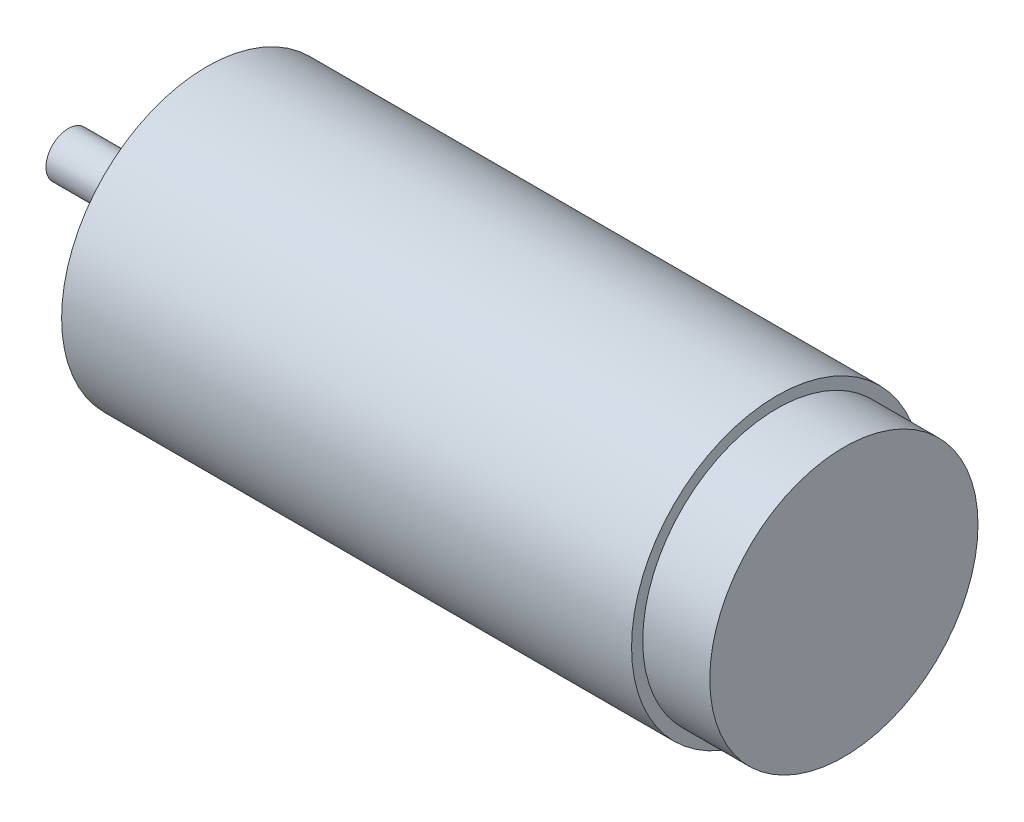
ISO-10303-21;
HEADER;
FILE_DESCRIPTION(('STEP AP214'),'2;1');
FILE_NAME('part.step','',(''),(''),'','','');
FILE_SCHEMA(('AUTOMOTIVE_DESIGN { 1 0 10303 214 1 1 1 1 }'));
ENDSEC;
DATA;
#1=APPLICATION_CONTEXT('core data for automotive mechanical design processes');
#2=APPLICATION_PROTOCOL_DEFINITION('international standard','automotive_design',2000,#1);
#3=PRODUCT_CONTEXT('',#1,'mechanical');
#4=PRODUCT('Part','Part','',(#3));
#5=PRODUCT_RELATED_PRODUCT_CATEGORY('part','',(#4));
#6=PRODUCT_DEFINITION_FORMATION('','',#4);
#7=PRODUCT_DEFINITION_CONTEXT('part definition',#1,'design');
#8=PRODUCT_DEFINITION('design','',#6,#7);
#9=PRODUCT_DEFINITION_SHAPE('','',#8);
#10=(LENGTH_UNIT() NAMED_UNIT(*) SI_UNIT(.MILLI.,.METRE.));
#11=(NAMED_UNIT(*) PLANE_ANGLE_UNIT() SI_UNIT($,.RADIAN.));
#12=(NAMED_UNIT(*) SI_UNIT($,.STERADIAN.) SOLID_ANGLE_UNIT());
#13=UNCERTAINTY_MEASURE_WITH_UNIT(LENGTH_MEASURE(1.E-05),#10,'distance_accuracy_value','');
#14=(GEOMETRIC_REPRESENTATION_CONTEXT(3) GLOBAL_UNCERTAINTY_ASSIGNED_CONTEXT((#13)) GLOBAL_UNIT_ASSIGNED_CONTEXT((#10,
#11,#12)) REPRESENTATION_CONTEXT('',''));
#15=CARTESIAN_POINT('',(0.,0.,0.));
#16=DIRECTION('',(0.,0.,1.));
#17=DIRECTION('',(1.,0.,0.));
#18=AXIS2_PLACEMENT_3D('',#15,#16,#17);
#19=CARTESIAN_POINT('',(0.,0.,0.));
#20=DIRECTION('',(1.,0.,0.));
#21=DIRECTION('',(0.,0.,-1.));
#22=AXIS2_PLACEMENT_3D('',#19,#20,#21);
#23=PLANE('',#22);
#24=CARTESIAN_POINT('',(0.,0.,0.));
#25=DIRECTION('',(1.,0.,0.));
#26=DIRECTION('',(0.,0.,-1.));
#27=AXIS2_PLACEMENT_3D('',#24,#25,#26);
#28=CIRCLE('',#27,12.);
#29=CARTESIAN_POINT('',(0.,0.,-12.));
#30=VERTEX_POINT('',#29);
#31=EDGE_CURVE('E11',#30,#30,#28,.T.);
#32=ORIENTED_EDGE('',*,*,#31,.T.);
#33=EDGE_LOOP('',(#32));
#34=FACE_BOUND('',#33,.T.);
#35=ADVANCED_FACE('F42',(#34),#23,.T.);
#36=CARTESIAN_POINT('',(0.,0.,0.));
#37=DIRECTION('',(1.,0.,0.));
#38=DIRECTION('',(0.,0.,-1.));
#39=AXIS2_PLACEMENT_3D('',#36,#37,#38);
#40=CYLINDRICAL_SURFACE('',#39,12.);
#41=CARTESIAN_POINT('',(-6.,0.,0.));
#42=DIRECTION('',(1.,0.,0.));
#43=DIRECTION('',(0.,0.,-1.));
#44=AXIS2_PLACEMENT_3D('',#41,#42,#43);
#45=CIRCLE('',#44,12.);
#46=CARTESIAN_POINT('',(-6.,0.,-12.));
#47=VERTEX_POINT('',#46);
#48=EDGE_CURVE('E49',#47,#47,#45,.T.);
#49=ORIENTED_EDGE('',*,*,#48,.T.);
#50=EDGE_LOOP('',(#49));
#51=FACE_BOUND('',#50,.T.);
#52=ORIENTED_EDGE('',*,*,#31,.F.);
#53=EDGE_LOOP('',(#52));
#54=FACE_BOUND('',#53,.T.);
#55=ADVANCED_FACE('F120',(#51,#54),#40,.T.);
#56=CARTESIAN_POINT('',(-6.,12.,0.));
#57=DIRECTION('',(1.,0.,0.));
#58=DIRECTION('',(0.,0.,-1.));
#59=AXIS2_PLACEMENT_3D('',#56,#57,#58);
#60=PLANE('',#59);
#61=CARTESIAN_POINT('',(-6.,0.,0.));
#62=DIRECTION('',(1.,0.,0.));
#63=DIRECTION('',(0.,0.,-1.));
#64=AXIS2_PLACEMENT_3D('',#61,#62,#63);
#65=CIRCLE('',#64,13.);
#66=CARTESIAN_POINT('',(-6.,0.,-13.));
#67=VERTEX_POINT('',#66);
#68=EDGE_CURVE('E115',#67,#67,#65,.T.);
#69=ORIENTED_EDGE('',*,*,#68,.T.);
#70=EDGE_LOOP('',(#69));
#71=FACE_BOUND('',#70,.T.);
#72=ORIENTED_EDGE('',*,*,#48,.F.);
#73=EDGE_LOOP('',(#72));
#74=FACE_BOUND('',#73,.T.);
#75=ADVANCED_FACE('F123',(#71,#74),#60,.T.);
#76=CARTESIAN_POINT('',(0.,0.,0.));
#77=DIRECTION('',(1.,0.,0.));
#78=DIRECTION('',(0.,0.,-1.));
#79=AXIS2_PLACEMENT_3D('',#76,#77,#78);
#80=CYLINDRICAL_SURFACE('',#79,13.);
#81=CARTESIAN_POINT('',(-57.,0.,0.));
#82=DIRECTION('',(1.,0.,0.));
#83=DIRECTION('',(0.,0.,-1.));
#84=AXIS2_PLACEMENT_3D('',#81,#82,#83);
#85=CIRCLE('',#84,13.);
#86=CARTESIAN_POINT('',(-57.,0.,-13.));
#87=VERTEX_POINT('',#86);
#88=EDGE_CURVE('E112',#87,#87,#85,.T.);
#89=ORIENTED_EDGE('',*,*,#88,.T.);
#90=EDGE_LOOP('',(#89));
#91=FACE_BOUND('',#90,.T.);
#92=ORIENTED_EDGE('',*,*,#68,.F.);
#93=EDGE_LOOP('',(#92));
#94=FACE_BOUND('',#93,.T.);
#95=ADVANCED_FACE('F125',(#91,#94),#80,.T.);
#96=CARTESIAN_POINT('',(-57.,13.,0.));
#97=DIRECTION('',(-1.,0.,0.));
#98=DIRECTION('',(0.,0.,1.));
#99=AXIS2_PLACEMENT_3D('',#96,#97,#98);
#100=PLANE('',#99);
#101=CARTESIAN_POINT('',(-57.,8.5,0.));
#102=DIRECTION('',(-1.,0.,0.));
#103=DIRECTION('',(0.,0.,1.));
#104=AXIS2_PLACEMENT_3D('',#101,#102,#103);
#105=CIRCLE('',#104,1.5);
#106=CARTESIAN_POINT('',(-57.,8.5,1.5));
#107=VERTEX_POINT('',#106);
#108=EDGE_CURVE('E71',#107,#107,#105,.T.);
#109=ORIENTED_EDGE('',*,*,#108,.F.);
#110=EDGE_LOOP('',(#109));
#111=FACE_BOUND('',#110,.T.);
#112=CARTESIAN_POINT('',(-57.,-4.24999999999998,7.36121593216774));
#113=DIRECTION('',(-1.,0.,0.));
#114=DIRECTION('',(0.,0.,1.));
#115=AXIS2_PLACEMENT_3D('',#112,#113,#114);
#116=CIRCLE('',#115,1.5);
#117=CARTESIAN_POINT('',(-57.,-4.24999999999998,8.86121593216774));
#118=VERTEX_POINT('',#117);
#119=EDGE_CURVE('E82',#118,#118,#116,.T.);
#120=ORIENTED_EDGE('',*,*,#119,.F.);
#121=EDGE_LOOP('',(#120));
#122=FACE_BOUND('',#121,.T.);
#123=CARTESIAN_POINT('',(-57.,-4.25000000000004,-7.36121593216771));
#124=DIRECTION('',(-1.,0.,0.));
#125=DIRECTION('',(0.,0.,1.));
#126=AXIS2_PLACEMENT_3D('',#123,#124,#125);
#127=CIRCLE('',#126,1.5);
#128=CARTESIAN_POINT('',(-57.,-4.25000000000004,-5.86121593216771));
#129=VERTEX_POINT('',#128);
#130=EDGE_CURVE('E91',#129,#129,#127,.T.);
#131=ORIENTED_EDGE('',*,*,#130,.F.);
#132=EDGE_LOOP('',(#131));
#133=FACE_BOUND('',#132,.T.);
#134=CARTESIAN_POINT('',(-57.,0.,0.));
#135=DIRECTION('',(1.,0.,0.));
#136=DIRECTION('',(0.,0.,-1.));
#137=AXIS2_PLACEMENT_3D('',#134,#135,#136);
#138=CIRCLE('',#137,4.99999999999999);
#139=CARTESIAN_POINT('',(-57.,0.,-4.99999999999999));
#140=VERTEX_POINT('',#139);
#141=EDGE_CURVE('E109',#140,#140,#138,.T.);
#142=ORIENTED_EDGE('',*,*,#141,.T.);
#143=EDGE_LOOP('',(#142));
#144=FACE_BOUND('',#143,.T.);
#145=ORIENTED_EDGE('',*,*,#88,.F.);
#146=EDGE_LOOP('',(#145));
#147=FACE_BOUND('',#146,.T.);
#148=ADVANCED_FACE('F132',(#111,#122,#133,#144,#147),#100,.T.);
#149=CARTESIAN_POINT('',(0.,0.,0.));
#150=DIRECTION('',(1.,0.,0.));
#151=DIRECTION('',(0.,0.,-1.));
#152=AXIS2_PLACEMENT_3D('',#149,#150,#151);
#153=CYLINDRICAL_SURFACE('',#152,4.99999999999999);
#154=CARTESIAN_POINT('',(-58.,0.,0.));
#155=DIRECTION('',(1.,0.,0.));
#156=DIRECTION('',(0.,0.,-1.));
#157=AXIS2_PLACEMENT_3D('',#154,#155,#156);
#158=CIRCLE('',#157,4.99999999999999);
#159=CARTESIAN_POINT('',(-58.,0.,-4.99999999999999));
#160=VERTEX_POINT('',#159);
#161=EDGE_CURVE('E106',#160,#160,#158,.T.);
#162=ORIENTED_EDGE('',*,*,#161,.T.);
#163=EDGE_LOOP('',(#162));
#164=FACE_BOUND('',#163,.T.);
#165=ORIENTED_EDGE('',*,*,#141,.F.);
#166=EDGE_LOOP('',(#165));
#167=FACE_BOUND('',#166,.T.);
#168=ADVANCED_FACE('F161',(#164,#167),#153,.T.);
#169=CARTESIAN_POINT('',(-58.,4.99999999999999,0.));
#170=DIRECTION('',(-1.,0.,0.));
#171=DIRECTION('',(0.,0.,1.));
#172=AXIS2_PLACEMENT_3D('',#169,#170,#171);
#173=PLANE('',#172);
#174=CARTESIAN_POINT('',(-58.,0.,0.));
#175=DIRECTION('',(1.,0.,0.));
#176=DIRECTION('',(0.,0.,-1.));
#177=AXIS2_PLACEMENT_3D('',#174,#175,#176);
#178=CIRCLE('',#177,3.24999999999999);
#179=CARTESIAN_POINT('',(-58.,0.,-3.24999999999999));
#180=VERTEX_POINT('',#179);
#181=EDGE_CURVE('E103',#180,#180,#178,.T.);
#182=ORIENTED_EDGE('',*,*,#181,.T.);
#183=EDGE_LOOP('',(#182));
#184=FACE_BOUND('',#183,.T.);
#185=ORIENTED_EDGE('',*,*,#161,.F.);
#186=EDGE_LOOP('',(#185));
#187=FACE_BOUND('',#186,.T.);
#188=ADVANCED_FACE('F166',(#184,#187),#173,.T.);
#189=CARTESIAN_POINT('',(0.,0.,0.));
#190=DIRECTION('',(1.,0.,0.));
#191=DIRECTION('',(0.,0.,-1.));
#192=AXIS2_PLACEMENT_3D('',#189,#190,#191);
#193=CYLINDRICAL_SURFACE('',#192,3.24999999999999);
#194=CARTESIAN_POINT('',(-59.4,0.,0.));
#195=DIRECTION('',(1.,0.,0.));
#196=DIRECTION('',(0.,0.,-1.));
#197=AXIS2_PLACEMENT_3D('',#194,#195,#196);
#198=CIRCLE('',#197,3.24999999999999);
#199=CARTESIAN_POINT('',(-59.4,0.,-3.24999999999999));
#200=VERTEX_POINT('',#199);
#201=EDGE_CURVE('E100',#200,#200,#198,.T.);
#202=ORIENTED_EDGE('',*,*,#201,.T.);
#203=EDGE_LOOP('',(#202));
#204=FACE_BOUND('',#203,.T.);
#205=ORIENTED_EDGE('',*,*,#181,.F.);
#206=EDGE_LOOP('',(#205));
#207=FACE_BOUND('',#206,.T.);
#208=ADVANCED_FACE('F176',(#204,#207),#193,.T.);
#209=CARTESIAN_POINT('',(-59.4,3.24999999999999,0.));
#210=DIRECTION('',(-1.,0.,0.));
#211=DIRECTION('',(0.,0.,1.));
#212=AXIS2_PLACEMENT_3D('',#209,#210,#211);
#213=PLANE('',#212);
#214=CARTESIAN_POINT('',(-59.4,0.,0.));
#215=DIRECTION('',(1.,0.,0.));
#216=DIRECTION('',(0.,0.,-1.));
#217=AXIS2_PLACEMENT_3D('',#214,#215,#216);
#218=CIRCLE('',#217,1.99999999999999);
#219=CARTESIAN_POINT('',(-59.4,0.,-1.99999999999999));
#220=VERTEX_POINT('',#219);
#221=EDGE_CURVE('E97',#220,#220,#218,.T.);
#222=ORIENTED_EDGE('',*,*,#221,.T.);
#223=EDGE_LOOP('',(#222));
#224=FACE_BOUND('',#223,.T.);
#225=ORIENTED_EDGE('',*,*,#201,.F.);
#226=EDGE_LOOP('',(#225));
#227=FACE_BOUND('',#226,.T.);
#228=ADVANCED_FACE('F186',(#224,#227),#213,.T.);
#229=CARTESIAN_POINT('',(0.,0.,0.));
#230=DIRECTION('',(1.,0.,0.));
#231=DIRECTION('',(0.,0.,-1.));
#232=AXIS2_PLACEMENT_3D('',#229,#230,#231);
#233=CYLINDRICAL_SURFACE('',#232,1.99999999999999);
#234=CARTESIAN_POINT('',(-69.4,0.,0.));
#235=DIRECTION('',(1.,0.,0.));
#236=DIRECTION('',(0.,0.,-1.));
#237=AXIS2_PLACEMENT_3D('',#234,#235,#236);
#238=CIRCLE('',#237,1.99999999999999);
#239=CARTESIAN_POINT('',(-69.4,0.,-1.99999999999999));
#240=VERTEX_POINT('',#239);
#241=EDGE_CURVE('E94',#240,#240,#238,.T.);
#242=ORIENTED_EDGE('',*,*,#241,.T.);
#243=EDGE_LOOP('',(#242));
#244=FACE_BOUND('',#243,.T.);
#245=ORIENTED_EDGE('',*,*,#221,.F.);
#246=EDGE_LOOP('',(#245));
#247=FACE_BOUND('',#246,.T.);
#248=ADVANCED_FACE('F196',(#244,#247),#233,.T.);
#249=CARTESIAN_POINT('',(-69.4,1.99999999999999,0.));
#250=DIRECTION('',(-1.,0.,0.));
#251=DIRECTION('',(0.,0.,1.));
#252=AXIS2_PLACEMENT_3D('',#249,#250,#251);
#253=PLANE('',#252);
#254=ORIENTED_EDGE('',*,*,#241,.F.);
#255=EDGE_LOOP('',(#254));
#256=FACE_BOUND('',#255,.T.);
#257=ADVANCED_FACE('F206',(#256),#253,.T.);
#258=CARTESIAN_POINT('',(-57.,-4.25000000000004,-7.36121593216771));
#259=DIRECTION('',(-1.,0.,0.));
#260=DIRECTION('',(0.,0.,1.));
#261=AXIS2_PLACEMENT_3D('',#258,#259,#260);
#262=CONICAL_SURFACE('',#261,1.5,0.78539816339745);
#263=CARTESIAN_POINT('',(-56.75,-4.25000000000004,-7.36121593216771));
#264=DIRECTION('',(-1.,0.,0.));
#265=DIRECTION('',(0.,0.,1.));
#266=AXIS2_PLACEMENT_3D('',#263,#264,#265);
#267=CIRCLE('',#266,1.25);
#268=CARTESIAN_POINT('',(-56.75,-4.25000000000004,-6.11121593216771));
#269=VERTEX_POINT('',#268);
#270=EDGE_CURVE('E88',#269,#269,#267,.T.);
#271=ORIENTED_EDGE('',*,*,#270,.F.);
#272=EDGE_LOOP('',(#271));
#273=FACE_BOUND('',#272,.T.);
#274=ORIENTED_EDGE('',*,*,#130,.T.);
#275=EDGE_LOOP('',(#274));
#276=FACE_BOUND('',#275,.T.);
#277=ADVANCED_FACE('F216',(#273,#276),#262,.F.);
#278=CARTESIAN_POINT('',(-57.,-4.25000000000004,-7.36121593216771));
#279=DIRECTION('',(-1.,0.,0.));
#280=DIRECTION('',(0.,0.,1.));
#281=AXIS2_PLACEMENT_3D('',#278,#279,#280);
#282=CYLINDRICAL_SURFACE('',#281,1.25);
#283=CARTESIAN_POINT('',(-51.5,-4.25000000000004,-7.36121593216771));
#284=DIRECTION('',(-1.,0.,0.));
#285=DIRECTION('',(0.,0.,1.));
#286=AXIS2_PLACEMENT_3D('',#283,#284,#285);
#287=CIRCLE('',#286,1.25);
#288=CARTESIAN_POINT('',(-51.5,-4.25000000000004,-6.11121593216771));
#289=VERTEX_POINT('',#288);
#290=EDGE_CURVE('E85',#289,#289,#287,.T.);
#291=ORIENTED_EDGE('',*,*,#290,.F.);
#292=EDGE_LOOP('',(#291));
#293=FACE_BOUND('',#292,.T.);
#294=ORIENTED_EDGE('',*,*,#270,.T.);
#295=EDGE_LOOP('',(#294));
#296=FACE_BOUND('',#295,.T.);
#297=ADVANCED_FACE('F233',(#293,#296),#282,.F.);
#298=CARTESIAN_POINT('',(-51.5,-4.25000000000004,-7.36121593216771));
#299=DIRECTION('',(-1.,0.,0.));
#300=DIRECTION('',(0.,0.,1.));
#301=AXIS2_PLACEMENT_3D('',#298,#299,#300);
#302=CONICAL_SURFACE('',#301,1.25,1.04719755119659);
#303=CARTESIAN_POINT('',(-50.778312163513,-4.25000000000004,-7.36121593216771));
#304=VERTEX_POINT('',#303);
#305=VERTEX_LOOP('',#304);
#306=FACE_BOUND('',#305,.T.);
#307=ORIENTED_EDGE('',*,*,#290,.T.);
#308=EDGE_LOOP('',(#307));
#309=FACE_BOUND('',#308,.T.);
#310=ADVANCED_FACE('F244',(#306,#309),#302,.F.);
#311=CARTESIAN_POINT('',(-57.,-4.24999999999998,7.36121593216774));
#312=DIRECTION('',(-1.,0.,0.));
#313=DIRECTION('',(0.,0.,1.));
#314=AXIS2_PLACEMENT_3D('',#311,#312,#313);
#315=CONICAL_SURFACE('',#314,1.5,0.78539816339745);
#316=CARTESIAN_POINT('',(-56.75,-4.24999999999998,7.36121593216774));
#317=DIRECTION('',(-1.,0.,0.));
#318=DIRECTION('',(0.,0.,1.));
#319=AXIS2_PLACEMENT_3D('',#316,#317,#318);
#320=CIRCLE('',#319,1.25);
#321=CARTESIAN_POINT('',(-56.75,-4.24999999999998,8.61121593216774));
#322=VERTEX_POINT('',#321);
#323=EDGE_CURVE('E79',#322,#322,#320,.T.);
#324=ORIENTED_EDGE('',*,*,#323,.F.);
#325=EDGE_LOOP('',(#324));
#326=FACE_BOUND('',#325,.T.);
#327=ORIENTED_EDGE('',*,*,#119,.T.);
#328=EDGE_LOOP('',(#327));
#329=FACE_BOUND('',#328,.T.);
#330=ADVANCED_FACE('F256',(#326,#329),#315,.F.);
#331=CARTESIAN_POINT('',(-57.,-4.24999999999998,7.36121593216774));
#332=DIRECTION('',(-1.,0.,0.));
#333=DIRECTION('',(0.,0.,1.));
#334=AXIS2_PLACEMENT_3D('',#331,#332,#333);
#335=CYLINDRICAL_SURFACE('',#334,1.25);
#336=CARTESIAN_POINT('',(-51.5,-4.24999999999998,7.36121593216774));
#337=DIRECTION('',(-1.,0.,0.));
#338=DIRECTION('',(0.,0.,1.));
#339=AXIS2_PLACEMENT_3D('',#336,#337,#338);
#340=CIRCLE('',#339,1.25);
#341=CARTESIAN_POINT('',(-51.5,-4.24999999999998,8.61121593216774));
#342=VERTEX_POINT('',#341);
#343=EDGE_CURVE('E76',#342,#342,#340,.T.);
#344=ORIENTED_EDGE('',*,*,#343,.F.);
#345=EDGE_LOOP('',(#344));
#346=FACE_BOUND('',#345,.T.);
#347=ORIENTED_EDGE('',*,*,#323,.T.);
#348=EDGE_LOOP('',(#347));
#349=FACE_BOUND('',#348,.T.);
#350=ADVANCED_FACE('F265',(#346,#349),#335,.F.);
#351=CARTESIAN_POINT('',(-51.5,-4.24999999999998,7.36121593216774));
#352=DIRECTION('',(-1.,0.,0.));
#353=DIRECTION('',(0.,0.,1.));
#354=AXIS2_PLACEMENT_3D('',#351,#352,#353);
#355=CONICAL_SURFACE('',#354,1.25,1.04719755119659);
#356=CARTESIAN_POINT('',(-50.778312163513,-4.24999999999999,7.36121593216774));
#357=VERTEX_POINT('',#356);
#358=VERTEX_LOOP('',#357);
#359=FACE_BOUND('',#358,.T.);
#360=ORIENTED_EDGE('',*,*,#343,.T.);
#361=EDGE_LOOP('',(#360));
#362=FACE_BOUND('',#361,.T.);
#363=ADVANCED_FACE('F275',(#359,#362),#355,.F.);
#364=CARTESIAN_POINT('',(-57.,8.5,0.));
#365=DIRECTION('',(-1.,0.,0.));
#366=DIRECTION('',(0.,0.,1.));
#367=AXIS2_PLACEMENT_3D('',#364,#365,#366);
#368=CONICAL_SURFACE('',#367,1.5,0.785398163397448);
#369=CARTESIAN_POINT('',(-56.75,8.5,0.));
#370=DIRECTION('',(-1.,0.,0.));
#371=DIRECTION('',(0.,0.,1.));
#372=AXIS2_PLACEMENT_3D('',#369,#370,#371);
#373=CIRCLE('',#372,1.25);
#374=CARTESIAN_POINT('',(-56.75,8.5,1.25));
#375=VERTEX_POINT('',#374);
#376=EDGE_CURVE('E68',#375,#375,#373,.T.);
#377=ORIENTED_EDGE('',*,*,#376,.F.);
#378=EDGE_LOOP('',(#377));
#379=FACE_BOUND('',#378,.T.);
#380=ORIENTED_EDGE('',*,*,#108,.T.);
#381=EDGE_LOOP('',(#380));
#382=FACE_BOUND('',#381,.T.);
#383=ADVANCED_FACE('F287',(#379,#382),#368,.F.);
#384=CARTESIAN_POINT('',(-57.,8.5,0.));
#385=DIRECTION('',(-1.,0.,0.));
#386=DIRECTION('',(0.,0.,1.));
#387=AXIS2_PLACEMENT_3D('',#384,#385,#386);
#388=CYLINDRICAL_SURFACE('',#387,1.25);
#389=CARTESIAN_POINT('',(-51.5,8.5,0.));
#390=DIRECTION('',(-1.,0.,0.));
#391=DIRECTION('',(0.,0.,1.));
#392=AXIS2_PLACEMENT_3D('',#389,#390,#391);
#393=CIRCLE('',#392,1.25);
#394=CARTESIAN_POINT('',(-51.5,8.5,1.25));
#395=VERTEX_POINT('',#394);
#396=EDGE_CURVE('E66',#395,#395,#393,.T.);
#397=ORIENTED_EDGE('',*,*,#396,.F.);
#398=EDGE_LOOP('',(#397));
#399=FACE_BOUND('',#398,.T.);
#400=ORIENTED_EDGE('',*,*,#376,.T.);
#401=EDGE_LOOP('',(#400));
#402=FACE_BOUND('',#401,.T.);
#403=ADVANCED_FACE('F62',(#399,#402),#388,.F.);
#404=CARTESIAN_POINT('',(-51.5,8.5,0.));
#405=DIRECTION('',(-1.,0.,0.));
#406=DIRECTION('',(0.,0.,1.));
#407=AXIS2_PLACEMENT_3D('',#404,#405,#406);
#408=CONICAL_SURFACE('',#407,1.25,1.04719755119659);
#409=CARTESIAN_POINT('',(-50.778312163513,8.5,0.));
#410=VERTEX_POINT('',#409);
#411=VERTEX_LOOP('',#410);
#412=FACE_BOUND('',#411,.T.);
#413=ORIENTED_EDGE('',*,*,#396,.T.);
#414=EDGE_LOOP('',(#413));
#415=FACE_BOUND('',#414,.T.);
#416=ADVANCED_FACE('F59',(#412,#415),#408,.F.);
#417=CLOSED_SHELL('',(#35,#55,#75,#95,#148,#168,#188,#208,#228,#248,#257,#277,#297,#310,#330,
#350,#363,#383,#403,#416));
#418=MANIFOLD_SOLID_BREP('B2',#417);
#419=ADVANCED_BREP_SHAPE_REPRESENTATION('',(#18,#418),#14);
#420=SHAPE_DEFINITION_REPRESENTATION(#9,#419);
ENDSEC;
END-ISO-10303-21;
